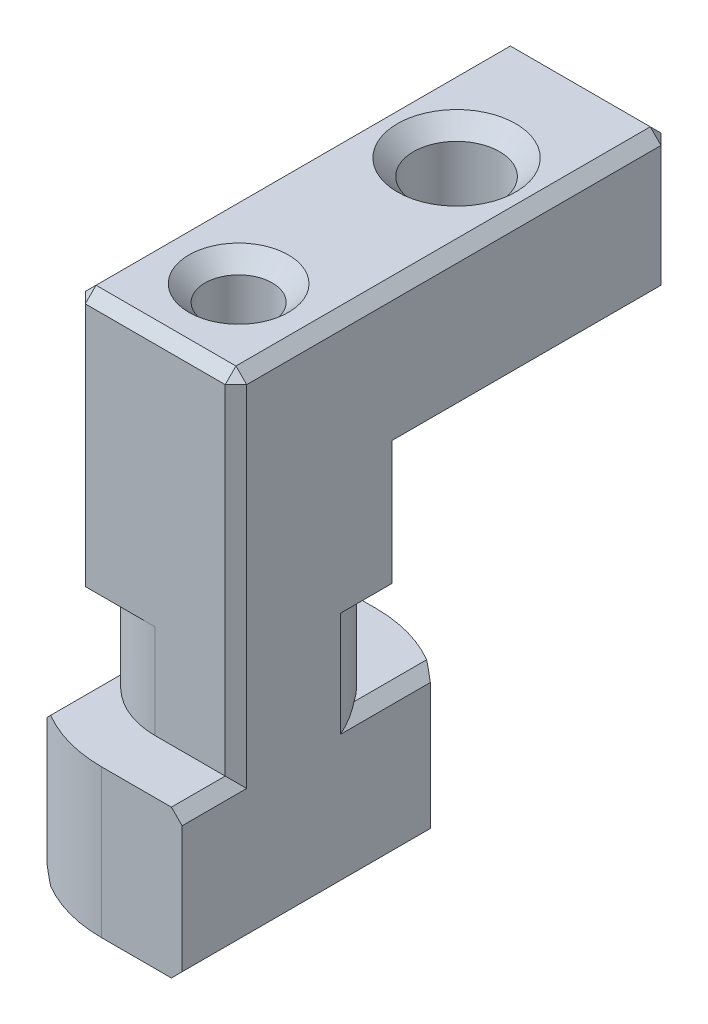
from build123d import *

# Parameters (mm, degrees)
EXTRUDE_1_DEPTH     = 5.5
EXTRUDE_2_DEPTH     = 3.5
SKETCH_18_W         = 6
SKETCH_18_H         = 6.2
EXTRUDE_4_DEPTH     = 4.2
SKETCH_4_W          = 6
SKETCH_4_H          = 16.2
EXTRUDE_3_DEPTH     = 5.3
SKETCH_6_R          = 1.25
CUT_EXTRUDE_1_DEPTH = 14
SKETCH_8_R          = 1.9
CUT_EXTRUDE_2_DEPTH = 4.5
CUT_EXTRUDE_3_REACH = 24.866
SKETCH_17_R         = 1.6
CHAMFER_3_SIZE      = 0.4
CHAMFER_4_SIZE      = 0.6


with BuildPart() as part:
    # Sketch 2 → Extrude 1 (new body)
    with BuildSketch(Plane(origin=(0, 0, 0), x_dir=(1, 0, 0), z_dir=(0, 1, 0))):
        with BuildLine():
            Line((3, -5.1), (3, 4.124318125))
            ThreePointArc((3, 4.124318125), (1.577335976, 4.84994961), (0, 5.1))
            Line((0, 5.1), (-3, 5.1))
            Line((-3, 5.1), (-3, -4.124318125))
            ThreePointArc((-3, -4.124318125), (-1.577335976, -4.84994961), (0, -5.1))
            Line((0, -5.1), (3, -5.1))
        make_face()
    extrude(amount=EXTRUDE_1_DEPTH)

    # Sketch 3 → Extrude 2 (add)
    with BuildSketch(Plane(origin=(0, 5.5, 0), x_dir=(1, 0, 0), z_dir=(0, 1, 0))):
        with BuildLine():
            Line((-3, 3.1), (0, 3.1))
            ThreePointArc((0, 3.1), (1.895893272, 2.452669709), (3, 0.781024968))
            Line((3, 0.781024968), (3, -3.1))
            Line((3, -3.1), (0, -3.1))
            ThreePointArc((0, -3.1), (-1.895893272, -2.452669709), (-3, -0.781024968))
            Line((-3, -0.781024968), (-3, 3.1))
        make_face()
    extrude(amount=EXTRUDE_2_DEPTH)

    # Sketch 18 → Extrude 4 (add)
    with BuildSketch(Plane(origin=(0, 9, 0), x_dir=(1, 0, 0), z_dir=(0, 1, 0))):
        Rectangle(SKETCH_18_W, SKETCH_18_H)
    extrude(amount=EXTRUDE_4_DEPTH)

    # Sketch 4 → Extrude 3 (add)
    with BuildSketch(Plane(origin=(0, 13.2, 0), x_dir=(1, 0, 0), z_dir=(0, 1, 0))):
        with Locations((0, 5)):
            Rectangle(SKETCH_4_W, SKETCH_4_H)
    extrude(amount=EXTRUDE_3_DEPTH)

    # Sketch 6 → Cut-Extrude 1 (cut)
    with BuildSketch(Plane(origin=(0, 18.5, 0), x_dir=(1, 0, 0), z_dir=(0, 1, 0))):
        with Locations(Location((0, 0, 0), (0, 0, 270))):
            Circle(SKETCH_6_R)
    extrude(amount=-CUT_EXTRUDE_1_DEPTH, mode=Mode.SUBTRACT)

    # Sketch 8 → Cut-Extrude 2 (cut)
    with BuildSketch(Plane.XZ):
        with Locations(Location((0, 0, 0), (0, 0, 270))):
            Circle(SKETCH_8_R)
    extrude(amount=-CUT_EXTRUDE_2_DEPTH, mode=Mode.SUBTRACT)

    # Sketch 17 → Cut-Extrude 3 (cut, up to next)
    with BuildSketch(Plane(origin=(0, 18.5, 0), x_dir=(1, 0, 0), z_dir=(0, 1, 0)), mode=Mode.PRIVATE) as cut_extrude_3_sk1:
        with Locations(Location((0, 8.1, 0), (0, 0, 270))):
            Circle(SKETCH_17_R)
    cut_extrude_3_tool1 = extrude(cut_extrude_3_sk1.sketch, amount=-CUT_EXTRUDE_3_REACH, mode=Mode.PRIVATE) & part.part
    add(cut_extrude_3_tool1.solids().sort_by_distance((0, 18.5, -8.1))[0], mode=Mode.SUBTRACT)

    # Chamfer 3
    chamfer_3_edges = [part.edges().sort_by_distance(p)[0] for p in [
        (3, 5.5, 4.1),
        (3, 5.5, -2.452671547),
        (-3, 5.5, 2.452671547),
        (-3, 9.35, -3.1),
        (3, 12, 3.1),
        (-3, 5.5, -4.1),
        (3, 11.1, -3.1),
        (-3, 13.75, 3.1),
        (0, 13.2, -13.1),
        (3, 15.85, -13.1),
        (-3, 13.2, -8.1),
        (-3, 15.85, -13.1),
        (3, 13.2, -8.1),
        (0, 18.5, -13.1),
        (-3, 18.5, -5),
        (0, 18.5, 3.1),
        (3, 18.5, -5),
        (-3, 0, -0.487840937),
        (3, 0, 0.487840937),
    ]]
    chamfer(chamfer_3_edges, length=CHAMFER_3_SIZE)

    # Chamfer 4
    chamfer_4_edges = [part.edges().sort_by_distance(p)[0] for p in [
        (0, 18.5, -1.25),
        (0, 0, 1.9),
        (0, 18.5, -9.7),
    ]]
    chamfer(chamfer_4_edges, length=CHAMFER_4_SIZE)


solid = part.part
